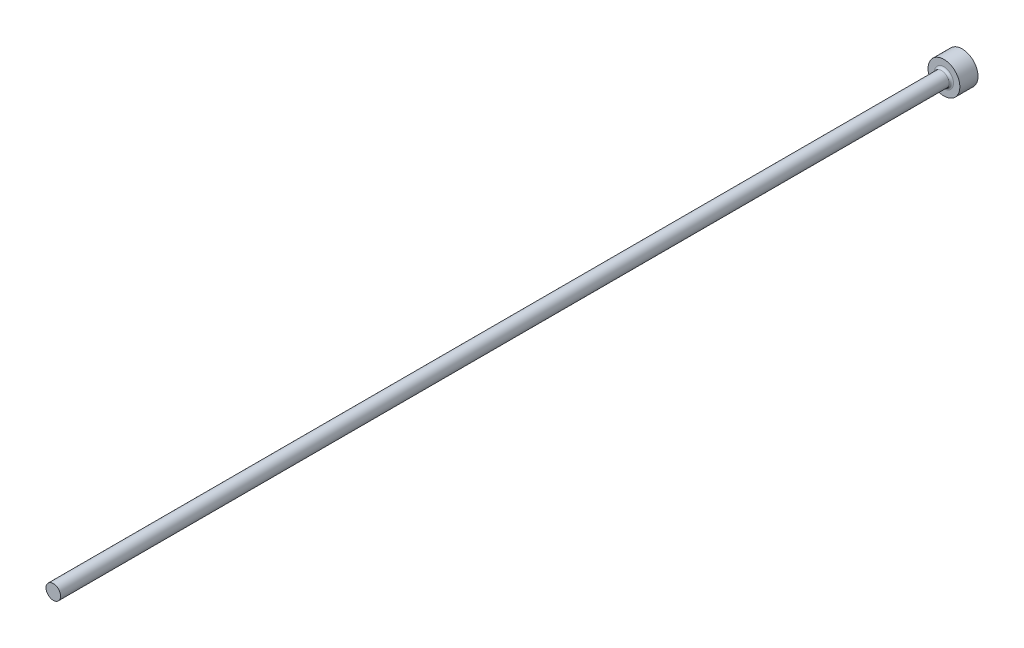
from build123d import *

# Parameters (mm, degrees)
FILLET1_R = 0.5


with BuildPart() as part:
    # FV → Revolve1 (revolve)
    with BuildSketch(Plane(origin=(0, 0, 0), x_dir=(1, 0, 0), z_dir=(0, 1, 0)), mode=Mode.PRIVATE) as revolve1_sk:
        Polygon((0, 0), (3.5, 0), (3.5, -4), (1.6, -4), (1.6, -200), (0, -200), align=None)
    revolve(revolve1_sk.sketch.rotate(Axis((0, 0, -9.033228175), (0, 0, 1)), 180), axis=Axis((0, 0, -9.033228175), (0, 0, 1)))

    # Fillet1
    fillet1_edges = [part.edges().sort_by_distance(p)[0] for p in [
        (1.6, 0, 4),
    ]]
    fillet(fillet1_edges, radius=FILLET1_R)


solid = part.part
